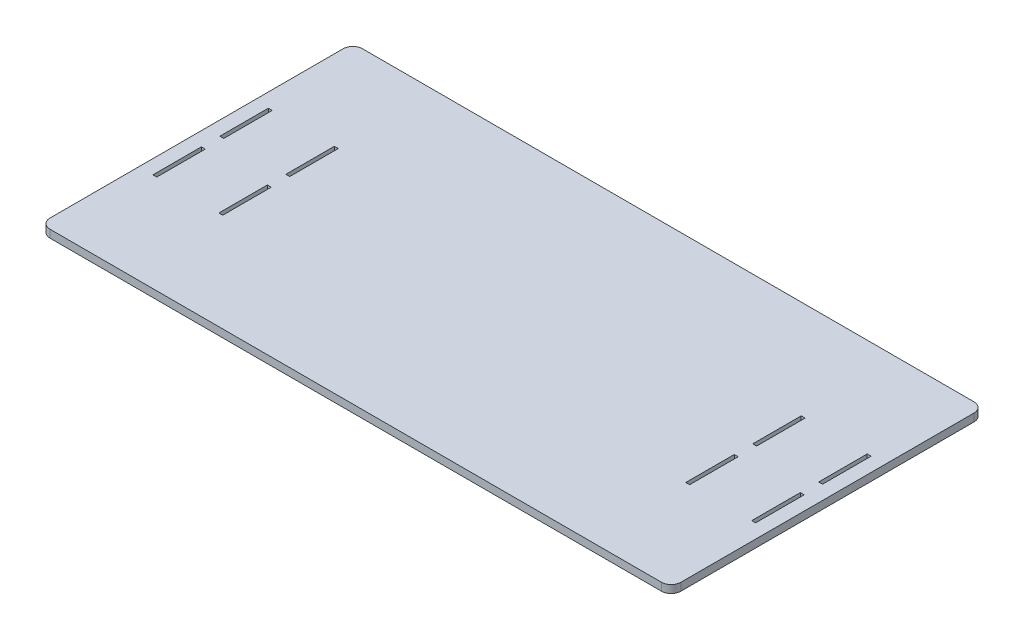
from build123d import *

# Parameters (mm, degrees)
SKETCH1_W           = 4
SKETCH1_H           = 50
BOSS_EXTRUDE1_DEPTH = 8


with BuildPart() as part:
    # Sketch1 → Boss-Extrude1 (new body)
    with BuildSketch(Plane(origin=(0, 0, 0), x_dir=(1, 0, 0), z_dir=(0, 1, 0))):
        with BuildLine():
            Line((-315, 161), (315, 161))
            ThreePointArc((315, 161), (322.071067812, 158.071067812), (325, 151))
            Line((325, 151), (325, -151))
            ThreePointArc((325, -151), (322.071067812, -158.071067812), (315, -161))
            Line((315, -161), (-315, -161))
            ThreePointArc((-315, -161), (-322.071067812, -158.071067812), (-325, -151))
            Line((-325, -151), (-325, 151))
            ThreePointArc((-325, 151), (-322.071067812, 158.071067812), (-315, 161))
        make_face()
        with Locations((-308.5, 34.5)):
            Rectangle(SKETCH1_W, SKETCH1_H, mode=Mode.SUBTRACT)
        with Locations((-240.5, 34.5)):
            Rectangle(SKETCH1_W, SKETCH1_H, mode=Mode.SUBTRACT)
        with Locations((-240.5, -34.5)):
            Rectangle(SKETCH1_W, SKETCH1_H, mode=Mode.SUBTRACT)
        with Locations((-308.5, -34.5)):
            Rectangle(SKETCH1_W, SKETCH1_H, mode=Mode.SUBTRACT)
        with Locations((308.5, -34.5)):
            Rectangle(SKETCH1_W, SKETCH1_H, mode=Mode.SUBTRACT)
        with Locations((240.5, -34.5)):
            Rectangle(SKETCH1_W, SKETCH1_H, mode=Mode.SUBTRACT)
        with Locations((240.5, 34.5)):
            Rectangle(SKETCH1_W, SKETCH1_H, mode=Mode.SUBTRACT)
        with Locations((308.5, 34.5)):
            Rectangle(SKETCH1_W, SKETCH1_H, mode=Mode.SUBTRACT)
    extrude(amount=BOSS_EXTRUDE1_DEPTH)


solid = part.part
